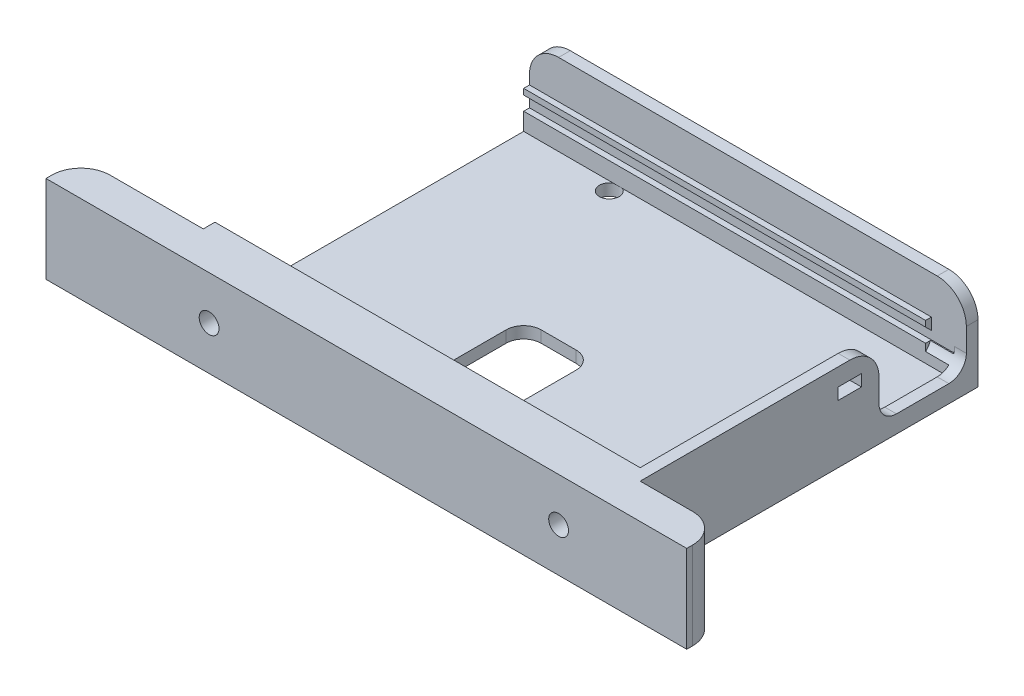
from build123d import *

# Parameters (mm, degrees)
CROQUIS1_W                       = 75
CROQUIS1_H                       = 58
SALIENTE_EXTRUIR1_DEPTH          = 15
CROQUIS2_W                       = 71
CROQUIS2_H                       = 54
CORTAR_EXTRUIR1_DEPTH            = 13
CORTAR_EXTRUIR3_REACH            = 97.99
CROQUIS4_W                       = 54
CROQUIS4_H                       = 13
RANURA_REACH                     = 97.99
CROQUIS5_W                       = 1
CROQUIS5_H                       = 3
CORTAR_EXTRUIR4_REACH            = 97.99
CORTAR_EXTRUIR5_DEPTH            = 6
CORTAR_EXTRUIR8_REACH            = 97.99
CROQUIS17_W                      = 4
CROQUIS17_H                      = 2
REDONDEO1_R                      = 5
CROQUIS18_W                      = 110
CROQUIS18_H                      = 15
SALIENTE_EXTRUIR4_DEPTH          = 6
CROQUIS7_W                       = 1
CROQUIS7_H                       = 3
CROQUIS7_H_2                     = 2
SALIENTE_EXTRUIR11_DEPTH         = 39
TALADRO_DE_MARGEN_PARA_M31_D     = 3.4
TALADRO_DE_MARGEN_PARA_M31_DEPTH = 4
TALADRO_DE_MARGEN_PARA_M31_TIP   = 1.021463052
REDONDEO2_R                      = 5


with BuildPart() as part:
    # Croquis1 → Saliente-Extruir1 (new body)
    with BuildSketch(Plane(origin=(0, 0, 0), x_dir=(1, 0, 0), z_dir=(0, 1, 0))):
        with Locations((37.5, 29)):
            Rectangle(CROQUIS1_W, CROQUIS1_H)
    extrude(amount=SALIENTE_EXTRUIR1_DEPTH)

    # Croquis2 → Cortar-Extruir1 (cut)
    with BuildSketch(Plane(origin=(0, 15, 0), x_dir=(1, 0, 0), z_dir=(0, 1, 0))):
        with Locations((37.5, 29)):
            Rectangle(CROQUIS2_W, CROQUIS2_H)
    extrude(amount=-CORTAR_EXTRUIR1_DEPTH, mode=Mode.SUBTRACT)

    # Croquis4 → Cortar-Extruir3 (cut, up to next)
    with BuildSketch(Plane.ZY, mode=Mode.PRIVATE) as cortar_extruir3_sk1:
        with Locations((-29, 8.5)):
            Rectangle(CROQUIS4_W, CROQUIS4_H)
    cortar_extruir3_tool1 = extrude(cortar_extruir3_sk1.sketch, amount=-CORTAR_EXTRUIR3_REACH, mode=Mode.PRIVATE) & part.part
    add(cortar_extruir3_tool1.solids().sort_by_distance((0, 8.5, -29))[0], mode=Mode.SUBTRACT)

    # Croquis5 → Ranura (add, up to next)
    with BuildSketch(Plane.ZY, mode=Mode.PRIVATE) as ranura_sk1:
        with Locations((-55.5, 3.5)):
            Rectangle(CROQUIS5_W, CROQUIS5_H)
    ranura_tool1 = extrude(ranura_sk1.sketch, amount=-RANURA_REACH, mode=Mode.PRIVATE) - part.part
    # Croquis5 → Ranura (add, up to next)
    with BuildSketch(Plane.ZY, mode=Mode.PRIVATE) as ranura_sk2:
        Polygon((-56, 6.4), (-56, 8.4), (-55, 8.4), (-55, 7.4), align=None)
    ranura_tool2 = extrude(ranura_sk2.sketch, amount=-RANURA_REACH, mode=Mode.PRIVATE) - part.part
    # Croquis5 → Ranura (add, up to next)
    with BuildSketch(Plane.ZY, mode=Mode.PRIVATE) as ranura_sk3:
        Polygon((-2, 6.4), (-3, 7.4), (-3, 8.4), (-2, 8.4), align=None)
    ranura_tool3 = extrude(ranura_sk3.sketch, amount=-RANURA_REACH, mode=Mode.PRIVATE) - part.part
    # Croquis5 → Ranura (add, up to next)
    with BuildSketch(Plane.ZY, mode=Mode.PRIVATE) as ranura_sk4:
        with Locations((-2.5, 3.5)):
            Rectangle(CROQUIS5_W, CROQUIS5_H)
    ranura_tool4 = extrude(ranura_sk4.sketch, amount=-RANURA_REACH, mode=Mode.PRIVATE) - part.part
    add(ranura_tool1.solids().sort_by_distance((0, 3.5, -55.5))[0])
    add(ranura_tool2.solids().sort_by_distance((0, 7.622222, -55.555556))[0])
    add(ranura_tool3.solids().sort_by_distance((0, 7.622222, -2.444444))[0])
    add(ranura_tool4.solids().sort_by_distance((0, 3.5, -2.5))[0])

    # Croquis6 → Cortar-Extruir4 (cut, up to next)
    with BuildSketch(Plane.XZ, mode=Mode.PRIVATE) as cortar_extruir4_sk1:
        with BuildLine():
            Line((31, -7), (37, -7))
            ThreePointArc((37, -7), (39.121320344, -7.878679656), (40, -10))
            Line((40, -10), (40, -24))
            ThreePointArc((40, -24), (39.121320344, -26.121320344), (37, -27))
            Line((37, -27), (31, -27))
            ThreePointArc((31, -27), (28.878679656, -26.121320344), (28, -24))
            Line((28, -24), (28, -10))
            ThreePointArc((28, -10), (28.878679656, -7.878679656), (31, -7))
        make_face()
    cortar_extruir4_tool1 = extrude(cortar_extruir4_sk1.sketch, amount=-CORTAR_EXTRUIR4_REACH, mode=Mode.PRIVATE) & part.part
    add(cortar_extruir4_tool1.solids().sort_by_distance((34, 0, -17))[0], mode=Mode.SUBTRACT)

    # Croquis3 → Cortar-Extruir5 (cut)
    with BuildSketch(Plane(origin=(75, 0, 0), x_dir=(0, 0, -1), z_dir=(1, 0, 0))):
        with BuildLine():
            Line((41, 15), (56, 15))
            Line((56, 15), (56, 6))
            ThreePointArc((56, 6), (55.121320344, 3.878679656), (53, 3))
            Line((53, 3), (44, 3))
            ThreePointArc((44, 3), (41.878679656, 3.878679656), (41, 6))
            Line((41, 6), (41, 15))
        make_face()
    extrude(amount=-CORTAR_EXTRUIR5_DEPTH, mode=Mode.SUBTRACT)

    # Croquis17 → Cortar-Extruir8 (cut, up to next)
    with BuildSketch(Plane(origin=(75, 0, 0), x_dir=(0, 0, -1), z_dir=(1, 0, 0)), mode=Mode.PRIVATE) as cortar_extruir8_sk1:
        with Locations((36, 11)):
            Rectangle(CROQUIS17_W, CROQUIS17_H)
    cortar_extruir8_tool1 = extrude(cortar_extruir8_sk1.sketch, amount=-CORTAR_EXTRUIR8_REACH, mode=Mode.PRIVATE) & part.part
    add(cortar_extruir8_tool1.solids().sort_by_distance((75, 11, -36))[0], mode=Mode.SUBTRACT)

    # Redondeo1
    redondeo1_edges = [part.edges().sort_by_distance(p)[0] for p in [
        (74, 15, -41),
        (75, 15, -57),
        (0, 15, -57),
    ]]
    fillet(redondeo1_edges, radius=REDONDEO1_R)

    # Croquis18 → Saliente-Extruir4 (add)
    with BuildSketch(Plane.XY):
        with Locations((34, 7.5)):
            Rectangle(CROQUIS18_W, CROQUIS18_H)
    extrude(amount=SALIENTE_EXTRUIR4_DEPTH)

    # Croquis7 → Saliente-Extruir11 (add)
    with BuildSketch(Plane(origin=(0, 0, -2), x_dir=(-1, 0, 0), z_dir=(0, 0, -1))):
        with Locations((-72.5, 3.5)):
            Rectangle(CROQUIS7_W, CROQUIS7_H)
        with Locations((-72.5, 7.4)):
            Rectangle(CROQUIS7_W, CROQUIS7_H_2)
    extrude(amount=SALIENTE_EXTRUIR11_DEPTH)

    # Taladro de margen para M31
    with Locations(Plane.XY.offset(6)):
        with Locations((7, 7.5), (67, 7.5)):
            Hole(TALADRO_DE_MARGEN_PARA_M31_D / 2, depth=TALADRO_DE_MARGEN_PARA_M31_DEPTH)
            with Locations((0, 0, -(TALADRO_DE_MARGEN_PARA_M31_DEPTH + TALADRO_DE_MARGEN_PARA_M31_TIP / 2))):  # 118° drill point
                Cone(0, TALADRO_DE_MARGEN_PARA_M31_D / 2, TALADRO_DE_MARGEN_PARA_M31_TIP, mode=Mode.SUBTRACT)

    # Croquis23 → Taladro de margen para M32 (revolve, cut)
    with BuildSketch(Plane(origin=(16.2, 2, -53.5), x_dir=(0, 0, 1), z_dir=(1, 0, 0))):
        Polygon((0, 0), (0, 5.021463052), (1.7, 4), (1.7, 0), align=None)
    revolve(axis=Axis((16.2, 8.35, -53.5), (0, -1, 0)), mode=Mode.SUBTRACT)

    # Redondeo2
    redondeo2_edges = [part.edges().sort_by_distance(p)[0] for p in [
        (-21, 7.5, 0),
        (89, 7.5, 0),
    ]]
    fillet(redondeo2_edges, radius=REDONDEO2_R)


solid = part.part
